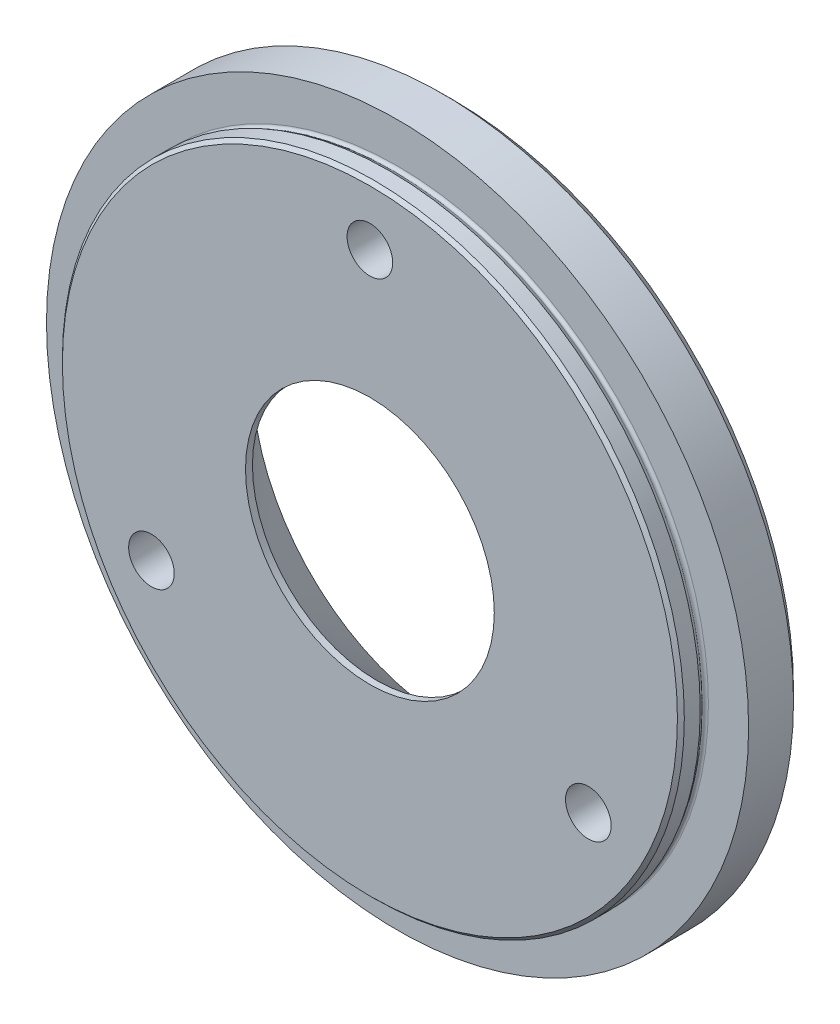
ISO-10303-21;
HEADER;
FILE_DESCRIPTION(('STEP AP214'),'2;1');
FILE_NAME('part.step','',(''),(''),'','','');
FILE_SCHEMA(('AUTOMOTIVE_DESIGN { 1 0 10303 214 1 1 1 1 }'));
ENDSEC;
DATA;
#1=APPLICATION_CONTEXT('core data for automotive mechanical design processes');
#2=APPLICATION_PROTOCOL_DEFINITION('international standard','automotive_design',2000,#1);
#3=PRODUCT_CONTEXT('',#1,'mechanical');
#4=PRODUCT('Part','Part','',(#3));
#5=PRODUCT_RELATED_PRODUCT_CATEGORY('part','',(#4));
#6=PRODUCT_DEFINITION_FORMATION('','',#4);
#7=PRODUCT_DEFINITION_CONTEXT('part definition',#1,'design');
#8=PRODUCT_DEFINITION('design','',#6,#7);
#9=PRODUCT_DEFINITION_SHAPE('','',#8);
#10=(LENGTH_UNIT() NAMED_UNIT(*) SI_UNIT(.MILLI.,.METRE.));
#11=(NAMED_UNIT(*) PLANE_ANGLE_UNIT() SI_UNIT($,.RADIAN.));
#12=(NAMED_UNIT(*) SI_UNIT($,.STERADIAN.) SOLID_ANGLE_UNIT());
#13=UNCERTAINTY_MEASURE_WITH_UNIT(LENGTH_MEASURE(1.E-05),#10,'distance_accuracy_value','');
#14=(GEOMETRIC_REPRESENTATION_CONTEXT(3) GLOBAL_UNCERTAINTY_ASSIGNED_CONTEXT((#13)) GLOBAL_UNIT_ASSIGNED_CONTEXT((#10,
#11,#12)) REPRESENTATION_CONTEXT('',''));
#15=CARTESIAN_POINT('',(0.,0.,0.));
#16=DIRECTION('',(0.,0.,1.));
#17=DIRECTION('',(1.,0.,0.));
#18=AXIS2_PLACEMENT_3D('',#15,#16,#17);
#19=CARTESIAN_POINT('',(0.,0.,4.));
#20=DIRECTION('',(0.,0.,1.));
#21=DIRECTION('',(1.,0.,0.));
#22=AXIS2_PLACEMENT_3D('',#19,#20,#21);
#23=CYLINDRICAL_SURFACE('',#22,45.);
#24=CARTESIAN_POINT('',(0.,0.,3.49999999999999));
#25=DIRECTION('',(0.,0.,1.));
#26=DIRECTION('',(1.,0.,0.));
#27=AXIS2_PLACEMENT_3D('',#24,#25,#26);
#28=CIRCLE('',#27,45.);
#29=CARTESIAN_POINT('',(45.,0.,3.49999999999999));
#30=VERTEX_POINT('',#29);
#31=EDGE_CURVE('E47',#30,#30,#28,.T.);
#32=ORIENTED_EDGE('',*,*,#31,.F.);
#33=EDGE_LOOP('',(#32));
#34=FACE_BOUND('',#33,.T.);
#35=CARTESIAN_POINT('',(0.,0.,1.2));
#36=DIRECTION('',(0.,0.,1.));
#37=DIRECTION('',(1.,0.,0.));
#38=AXIS2_PLACEMENT_3D('',#35,#36,#37);
#39=CIRCLE('',#38,45.);
#40=CARTESIAN_POINT('',(45.,0.,1.2));
#41=VERTEX_POINT('',#40);
#42=EDGE_CURVE('E70',#41,#41,#39,.T.);
#43=ORIENTED_EDGE('',*,*,#42,.T.);
#44=EDGE_LOOP('',(#43));
#45=FACE_BOUND('',#44,.T.);
#46=ADVANCED_FACE('F32',(#34,#45),#23,.T.);
#47=CARTESIAN_POINT('',(0.,44.5,4.));
#48=DIRECTION('',(0.,0.,-1.));
#49=DIRECTION('',(-1.,0.,0.));
#50=AXIS2_PLACEMENT_3D('',#47,#48,#49);
#51=PLANE('',#50);
#52=CARTESIAN_POINT('',(0.,36.5,4.));
#53=DIRECTION('',(0.,0.,-1.));
#54=DIRECTION('',(-1.,0.,0.));
#55=AXIS2_PLACEMENT_3D('',#52,#53,#54);
#56=CIRCLE('',#55,3.3);
#57=CARTESIAN_POINT('',(-3.30000000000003,36.5,4.));
#58=VERTEX_POINT('',#57);
#59=EDGE_CURVE('E97',#58,#58,#56,.T.);
#60=ORIENTED_EDGE('',*,*,#59,.T.);
#61=EDGE_LOOP('',(#60));
#62=FACE_BOUND('',#61,.T.);
#63=CARTESIAN_POINT('',(-31.6099272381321,-18.25,4.));
#64=DIRECTION('',(0.,0.,-1.));
#65=DIRECTION('',(-1.,0.,0.));
#66=AXIS2_PLACEMENT_3D('',#63,#64,#65);
#67=CIRCLE('',#66,3.3);
#68=CARTESIAN_POINT('',(-34.909927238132,-18.25,4.));
#69=VERTEX_POINT('',#68);
#70=EDGE_CURVE('E85',#69,#69,#67,.T.);
#71=ORIENTED_EDGE('',*,*,#70,.T.);
#72=EDGE_LOOP('',(#71));
#73=FACE_BOUND('',#72,.T.);
#74=CARTESIAN_POINT('',(31.609927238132,-18.25,4.));
#75=DIRECTION('',(0.,0.,-1.));
#76=DIRECTION('',(-1.,0.,0.));
#77=AXIS2_PLACEMENT_3D('',#74,#75,#76);
#78=CIRCLE('',#77,3.3);
#79=CARTESIAN_POINT('',(28.309927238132,-18.25,4.));
#80=VERTEX_POINT('',#79);
#81=EDGE_CURVE('E73',#80,#80,#78,.T.);
#82=ORIENTED_EDGE('',*,*,#81,.T.);
#83=EDGE_LOOP('',(#82));
#84=FACE_BOUND('',#83,.T.);
#85=CARTESIAN_POINT('',(0.,0.,4.));
#86=DIRECTION('',(0.,0.,1.));
#87=DIRECTION('',(1.,0.,0.));
#88=AXIS2_PLACEMENT_3D('',#85,#86,#87);
#89=CIRCLE('',#88,18.);
#90=CARTESIAN_POINT('',(18.,0.,4.));
#91=VERTEX_POINT('',#90);
#92=EDGE_CURVE('E10',#91,#91,#89,.T.);
#93=ORIENTED_EDGE('',*,*,#92,.F.);
#94=EDGE_LOOP('',(#93));
#95=FACE_BOUND('',#94,.T.);
#96=CARTESIAN_POINT('',(0.,0.,4.));
#97=DIRECTION('',(0.,0.,1.));
#98=DIRECTION('',(1.,0.,0.));
#99=AXIS2_PLACEMENT_3D('',#96,#97,#98);
#100=CIRCLE('',#99,44.5);
#101=CARTESIAN_POINT('',(44.5,0.,4.));
#102=VERTEX_POINT('',#101);
#103=EDGE_CURVE('E52',#102,#102,#100,.T.);
#104=ORIENTED_EDGE('',*,*,#103,.T.);
#105=EDGE_LOOP('',(#104));
#106=FACE_BOUND('',#105,.T.);
#107=ADVANCED_FACE('F34',(#62,#73,#84,#95,#106),#51,.F.);
#108=CARTESIAN_POINT('',(0.,0.,4.));
#109=DIRECTION('',(0.,0.,1.));
#110=DIRECTION('',(1.,0.,0.));
#111=AXIS2_PLACEMENT_3D('',#108,#109,#110);
#112=CYLINDRICAL_SURFACE('',#111,18.);
#113=CARTESIAN_POINT('',(0.,0.,3.));
#114=DIRECTION('',(0.,0.,1.));
#115=DIRECTION('',(1.,0.,0.));
#116=AXIS2_PLACEMENT_3D('',#113,#114,#115);
#117=CIRCLE('',#116,18.);
#118=CARTESIAN_POINT('',(18.,0.,3.));
#119=VERTEX_POINT('',#118);
#120=EDGE_CURVE('E39',#119,#119,#117,.T.);
#121=ORIENTED_EDGE('',*,*,#120,.F.);
#122=EDGE_LOOP('',(#121));
#123=FACE_BOUND('',#122,.T.);
#124=ORIENTED_EDGE('',*,*,#92,.T.);
#125=EDGE_LOOP('',(#124));
#126=FACE_BOUND('',#125,.T.);
#127=ADVANCED_FACE('F149',(#123,#126),#112,.F.);
#128=CARTESIAN_POINT('',(0.,0.,3.));
#129=DIRECTION('',(0.,0.,-1.));
#130=DIRECTION('',(-1.,0.,0.));
#131=AXIS2_PLACEMENT_3D('',#128,#129,#130);
#132=CONICAL_SURFACE('',#131,18.,0.785398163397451);
#133=CARTESIAN_POINT('',(0.,0.,-8.));
#134=DIRECTION('',(0.,0.,1.));
#135=DIRECTION('',(1.,0.,0.));
#136=AXIS2_PLACEMENT_3D('',#133,#134,#135);
#137=CIRCLE('',#136,29.0000000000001);
#138=CARTESIAN_POINT('',(29.,0.,-8.));
#139=VERTEX_POINT('',#138);
#140=EDGE_CURVE('E43',#139,#139,#137,.T.);
#141=ORIENTED_EDGE('',*,*,#140,.F.);
#142=EDGE_LOOP('',(#141));
#143=FACE_BOUND('',#142,.T.);
#144=ORIENTED_EDGE('',*,*,#120,.T.);
#145=EDGE_LOOP('',(#144));
#146=FACE_BOUND('',#145,.T.);
#147=ADVANCED_FACE('F116',(#143,#146),#132,.F.);
#148=CARTESIAN_POINT('',(0.,29.0000000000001,-8.));
#149=DIRECTION('',(0.,0.,1.));
#150=DIRECTION('',(1.,0.,0.));
#151=AXIS2_PLACEMENT_3D('',#148,#149,#150);
#152=PLANE('',#151);
#153=CARTESIAN_POINT('',(0.,36.5,-8.));
#154=DIRECTION('',(0.,0.,-1.));
#155=DIRECTION('',(-1.,0.,0.));
#156=AXIS2_PLACEMENT_3D('',#153,#154,#155);
#157=CIRCLE('',#156,5.5);
#158=CARTESIAN_POINT('',(-5.50000000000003,36.5,-8.));
#159=VERTEX_POINT('',#158);
#160=EDGE_CURVE('E106',#159,#159,#157,.T.);
#161=ORIENTED_EDGE('',*,*,#160,.F.);
#162=EDGE_LOOP('',(#161));
#163=FACE_BOUND('',#162,.T.);
#164=CARTESIAN_POINT('',(-31.6099272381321,-18.25,-8.));
#165=DIRECTION('',(0.,0.,-1.));
#166=DIRECTION('',(-1.,0.,0.));
#167=AXIS2_PLACEMENT_3D('',#164,#165,#166);
#168=CIRCLE('',#167,5.5);
#169=CARTESIAN_POINT('',(-37.1099272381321,-18.25,-8.));
#170=VERTEX_POINT('',#169);
#171=EDGE_CURVE('E94',#170,#170,#168,.T.);
#172=ORIENTED_EDGE('',*,*,#171,.F.);
#173=EDGE_LOOP('',(#172));
#174=FACE_BOUND('',#173,.T.);
#175=CARTESIAN_POINT('',(31.609927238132,-18.25,-8.));
#176=DIRECTION('',(0.,0.,-1.));
#177=DIRECTION('',(-1.,0.,0.));
#178=AXIS2_PLACEMENT_3D('',#175,#176,#177);
#179=CIRCLE('',#178,5.5);
#180=CARTESIAN_POINT('',(26.109927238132,-18.25,-8.));
#181=VERTEX_POINT('',#180);
#182=EDGE_CURVE('E82',#181,#181,#179,.T.);
#183=ORIENTED_EDGE('',*,*,#182,.F.);
#184=EDGE_LOOP('',(#183));
#185=FACE_BOUND('',#184,.T.);
#186=ORIENTED_EDGE('',*,*,#140,.T.);
#187=EDGE_LOOP('',(#186));
#188=FACE_BOUND('',#187,.T.);
#189=CARTESIAN_POINT('',(0.,0.,-8.));
#190=DIRECTION('',(0.,0.,1.));
#191=DIRECTION('',(1.,0.,0.));
#192=AXIS2_PLACEMENT_3D('',#189,#190,#191);
#193=CIRCLE('',#192,49.3);
#194=CARTESIAN_POINT('',(49.3,0.,-8.));
#195=VERTEX_POINT('',#194);
#196=EDGE_CURVE('E61',#195,#195,#193,.T.);
#197=ORIENTED_EDGE('',*,*,#196,.F.);
#198=EDGE_LOOP('',(#197));
#199=FACE_BOUND('',#198,.T.);
#200=ADVANCED_FACE('F112',(#163,#174,#185,#188,#199),#152,.F.);
#201=CARTESIAN_POINT('',(0.,0.,3.49999999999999));
#202=DIRECTION('',(0.,0.,-1.));
#203=DIRECTION('',(-1.,0.,0.));
#204=AXIS2_PLACEMENT_3D('',#201,#202,#203);
#205=CONICAL_SURFACE('',#204,45.,0.785398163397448);
#206=ORIENTED_EDGE('',*,*,#103,.F.);
#207=EDGE_LOOP('',(#206));
#208=FACE_BOUND('',#207,.T.);
#209=ORIENTED_EDGE('',*,*,#31,.T.);
#210=EDGE_LOOP('',(#209));
#211=FACE_BOUND('',#210,.T.);
#212=ADVANCED_FACE('F115',(#208,#211),#205,.T.);
#213=CARTESIAN_POINT('',(0.,45.,0.));
#214=DIRECTION('',(0.,0.,-1.));
#215=DIRECTION('',(-1.,0.,0.));
#216=AXIS2_PLACEMENT_3D('',#213,#214,#215);
#217=PLANE('',#216);
#218=CARTESIAN_POINT('',(0.,0.,0.));
#219=DIRECTION('',(0.,0.,1.));
#220=DIRECTION('',(1.,0.,0.));
#221=AXIS2_PLACEMENT_3D('',#218,#219,#220);
#222=CIRCLE('',#221,50.8);
#223=CARTESIAN_POINT('',(50.8,0.,0.));
#224=VERTEX_POINT('',#223);
#225=EDGE_CURVE('E55',#224,#224,#222,.T.);
#226=ORIENTED_EDGE('',*,*,#225,.T.);
#227=EDGE_LOOP('',(#226));
#228=FACE_BOUND('',#227,.T.);
#229=CARTESIAN_POINT('',(0.,0.,0.));
#230=DIRECTION('',(0.,0.,1.));
#231=DIRECTION('',(1.,0.,0.));
#232=AXIS2_PLACEMENT_3D('',#229,#230,#231);
#233=CIRCLE('',#232,44.9859648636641);
#234=CARTESIAN_POINT('',(44.9859648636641,0.,0.));
#235=VERTEX_POINT('',#234);
#236=EDGE_CURVE('E64',#235,#235,#233,.T.);
#237=ORIENTED_EDGE('',*,*,#236,.F.);
#238=EDGE_LOOP('',(#237));
#239=FACE_BOUND('',#238,.T.);
#240=ADVANCED_FACE('F139',(#228,#239),#217,.F.);
#241=CARTESIAN_POINT('',(0.,0.,4.));
#242=DIRECTION('',(0.,0.,1.));
#243=DIRECTION('',(1.,0.,0.));
#244=AXIS2_PLACEMENT_3D('',#241,#242,#243);
#245=CYLINDRICAL_SURFACE('',#244,50.8);
#246=ORIENTED_EDGE('',*,*,#225,.F.);
#247=EDGE_LOOP('',(#246));
#248=FACE_BOUND('',#247,.T.);
#249=CARTESIAN_POINT('',(0.,0.,-6.5));
#250=DIRECTION('',(0.,0.,1.));
#251=DIRECTION('',(1.,0.,0.));
#252=AXIS2_PLACEMENT_3D('',#249,#250,#251);
#253=CIRCLE('',#252,50.8);
#254=CARTESIAN_POINT('',(50.8,0.,-6.5));
#255=VERTEX_POINT('',#254);
#256=EDGE_CURVE('E58',#255,#255,#253,.T.);
#257=ORIENTED_EDGE('',*,*,#256,.T.);
#258=EDGE_LOOP('',(#257));
#259=FACE_BOUND('',#258,.T.);
#260=ADVANCED_FACE('F129',(#248,#259),#245,.T.);
#261=CARTESIAN_POINT('',(0.,0.,-8.));
#262=DIRECTION('',(0.,0.,1.));
#263=DIRECTION('',(1.,0.,0.));
#264=AXIS2_PLACEMENT_3D('',#261,#262,#263);
#265=CONICAL_SURFACE('',#264,49.3,0.785398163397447);
#266=ORIENTED_EDGE('',*,*,#256,.F.);
#267=EDGE_LOOP('',(#266));
#268=FACE_BOUND('',#267,.T.);
#269=ORIENTED_EDGE('',*,*,#196,.T.);
#270=EDGE_LOOP('',(#269));
#271=FACE_BOUND('',#270,.T.);
#272=ADVANCED_FACE('F126',(#268,#271),#265,.T.);
#273=CARTESIAN_POINT('',(0.,0.,0.400000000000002));
#274=DIRECTION('',(0.,0.,1.));
#275=DIRECTION('',(1.,0.,0.));
#276=AXIS2_PLACEMENT_3D('',#273,#274,#275);
#277=TOROIDAL_SURFACE('',#276,44.9859648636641,0.400000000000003);
#278=ORIENTED_EDGE('',*,*,#236,.T.);
#279=EDGE_LOOP('',(#278));
#280=FACE_BOUND('',#279,.T.);
#281=CARTESIAN_POINT('',(0.,0.,0.606015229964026));
#282=DIRECTION('',(0.,0.,1.));
#283=DIRECTION('',(1.,0.,0.));
#284=AXIS2_PLACEMENT_3D('',#281,#282,#283);
#285=CIRCLE('',#284,44.6430979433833);
#286=CARTESIAN_POINT('',(44.6430979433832,0.,0.606015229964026));
#287=VERTEX_POINT('',#286);
#288=EDGE_CURVE('E67',#287,#287,#285,.T.);
#289=ORIENTED_EDGE('',*,*,#288,.F.);
#290=EDGE_LOOP('',(#289));
#291=FACE_BOUND('',#290,.T.);
#292=ADVANCED_FACE('F128',(#280,#291),#277,.F.);
#293=CARTESIAN_POINT('',(0.,0.,1.2));
#294=DIRECTION('',(0.,0.,1.));
#295=DIRECTION('',(1.,0.,0.));
#296=AXIS2_PLACEMENT_3D('',#293,#294,#295);
#297=CONICAL_SURFACE('',#296,45.,0.541052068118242);
#298=ORIENTED_EDGE('',*,*,#288,.T.);
#299=EDGE_LOOP('',(#298));
#300=FACE_BOUND('',#299,.T.);
#301=ORIENTED_EDGE('',*,*,#42,.F.);
#302=EDGE_LOOP('',(#301));
#303=FACE_BOUND('',#302,.T.);
#304=ADVANCED_FACE('F136',(#300,#303),#297,.T.);
#305=CARTESIAN_POINT('',(31.609927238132,-18.25,-8.));
#306=DIRECTION('',(0.,0.,-1.));
#307=DIRECTION('',(-1.,0.,0.));
#308=AXIS2_PLACEMENT_3D('',#305,#306,#307);
#309=CYLINDRICAL_SURFACE('',#308,3.3);
#310=ORIENTED_EDGE('',*,*,#81,.F.);
#311=EDGE_LOOP('',(#310));
#312=FACE_BOUND('',#311,.T.);
#313=CARTESIAN_POINT('',(31.609927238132,-18.25,-1.));
#314=DIRECTION('',(0.,0.,-1.));
#315=DIRECTION('',(-1.,0.,0.));
#316=AXIS2_PLACEMENT_3D('',#313,#314,#315);
#317=CIRCLE('',#316,3.3);
#318=CARTESIAN_POINT('',(28.309927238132,-18.25,-1.));
#319=VERTEX_POINT('',#318);
#320=EDGE_CURVE('E76',#319,#319,#317,.T.);
#321=ORIENTED_EDGE('',*,*,#320,.T.);
#322=EDGE_LOOP('',(#321));
#323=FACE_BOUND('',#322,.T.);
#324=ADVANCED_FACE('F217',(#312,#323),#309,.F.);
#325=CARTESIAN_POINT('',(34.909927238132,-18.25,-1.));
#326=DIRECTION('',(0.,0.,1.));
#327=DIRECTION('',(1.,0.,0.));
#328=AXIS2_PLACEMENT_3D('',#325,#326,#327);
#329=PLANE('',#328);
#330=ORIENTED_EDGE('',*,*,#320,.F.);
#331=EDGE_LOOP('',(#330));
#332=FACE_BOUND('',#331,.T.);
#333=CARTESIAN_POINT('',(31.609927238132,-18.25,-1.));
#334=DIRECTION('',(0.,0.,-1.));
#335=DIRECTION('',(-1.,0.,0.));
#336=AXIS2_PLACEMENT_3D('',#333,#334,#335);
#337=CIRCLE('',#336,5.5);
#338=CARTESIAN_POINT('',(26.109927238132,-18.25,-1.));
#339=VERTEX_POINT('',#338);
#340=EDGE_CURVE('E79',#339,#339,#337,.T.);
#341=ORIENTED_EDGE('',*,*,#340,.T.);
#342=EDGE_LOOP('',(#341));
#343=FACE_BOUND('',#342,.T.);
#344=ADVANCED_FACE('F225',(#332,#343),#329,.F.);
#345=CARTESIAN_POINT('',(31.609927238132,-18.25,-8.));
#346=DIRECTION('',(0.,0.,-1.));
#347=DIRECTION('',(-1.,0.,0.));
#348=AXIS2_PLACEMENT_3D('',#345,#346,#347);
#349=CYLINDRICAL_SURFACE('',#348,5.5);
#350=ORIENTED_EDGE('',*,*,#340,.F.);
#351=EDGE_LOOP('',(#350));
#352=FACE_BOUND('',#351,.T.);
#353=ORIENTED_EDGE('',*,*,#182,.T.);
#354=EDGE_LOOP('',(#353));
#355=FACE_BOUND('',#354,.T.);
#356=ADVANCED_FACE('F234',(#352,#355),#349,.F.);
#357=CARTESIAN_POINT('',(-31.6099272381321,-18.25,-8.));
#358=DIRECTION('',(0.,0.,-1.));
#359=DIRECTION('',(-1.,0.,0.));
#360=AXIS2_PLACEMENT_3D('',#357,#358,#359);
#361=CYLINDRICAL_SURFACE('',#360,3.3);
#362=ORIENTED_EDGE('',*,*,#70,.F.);
#363=EDGE_LOOP('',(#362));
#364=FACE_BOUND('',#363,.T.);
#365=CARTESIAN_POINT('',(-31.6099272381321,-18.25,-1.));
#366=DIRECTION('',(0.,0.,-1.));
#367=DIRECTION('',(-1.,0.,0.));
#368=AXIS2_PLACEMENT_3D('',#365,#366,#367);
#369=CIRCLE('',#368,3.3);
#370=CARTESIAN_POINT('',(-34.909927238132,-18.25,-1.));
#371=VERTEX_POINT('',#370);
#372=EDGE_CURVE('E88',#371,#371,#369,.T.);
#373=ORIENTED_EDGE('',*,*,#372,.T.);
#374=EDGE_LOOP('',(#373));
#375=FACE_BOUND('',#374,.T.);
#376=ADVANCED_FACE('F243',(#364,#375),#361,.F.);
#377=CARTESIAN_POINT('',(-28.3099272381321,-18.25,-1.));
#378=DIRECTION('',(0.,0.,1.));
#379=DIRECTION('',(1.,0.,0.));
#380=AXIS2_PLACEMENT_3D('',#377,#378,#379);
#381=PLANE('',#380);
#382=ORIENTED_EDGE('',*,*,#372,.F.);
#383=EDGE_LOOP('',(#382));
#384=FACE_BOUND('',#383,.T.);
#385=CARTESIAN_POINT('',(-31.6099272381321,-18.25,-1.));
#386=DIRECTION('',(0.,0.,-1.));
#387=DIRECTION('',(-1.,0.,0.));
#388=AXIS2_PLACEMENT_3D('',#385,#386,#387);
#389=CIRCLE('',#388,5.5);
#390=CARTESIAN_POINT('',(-37.1099272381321,-18.25,-1.));
#391=VERTEX_POINT('',#390);
#392=EDGE_CURVE('E91',#391,#391,#389,.T.);
#393=ORIENTED_EDGE('',*,*,#392,.T.);
#394=EDGE_LOOP('',(#393));
#395=FACE_BOUND('',#394,.T.);
#396=ADVANCED_FACE('F252',(#384,#395),#381,.F.);
#397=CARTESIAN_POINT('',(-31.6099272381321,-18.25,-8.));
#398=DIRECTION('',(0.,0.,-1.));
#399=DIRECTION('',(-1.,0.,0.));
#400=AXIS2_PLACEMENT_3D('',#397,#398,#399);
#401=CYLINDRICAL_SURFACE('',#400,5.5);
#402=ORIENTED_EDGE('',*,*,#392,.F.);
#403=EDGE_LOOP('',(#402));
#404=FACE_BOUND('',#403,.T.);
#405=ORIENTED_EDGE('',*,*,#171,.T.);
#406=EDGE_LOOP('',(#405));
#407=FACE_BOUND('',#406,.T.);
#408=ADVANCED_FACE('F261',(#404,#407),#401,.F.);
#409=CARTESIAN_POINT('',(0.,36.5,-8.));
#410=DIRECTION('',(0.,0.,-1.));
#411=DIRECTION('',(-1.,0.,0.));
#412=AXIS2_PLACEMENT_3D('',#409,#410,#411);
#413=CYLINDRICAL_SURFACE('',#412,3.3);
#414=ORIENTED_EDGE('',*,*,#59,.F.);
#415=EDGE_LOOP('',(#414));
#416=FACE_BOUND('',#415,.T.);
#417=CARTESIAN_POINT('',(0.,36.5,-1.));
#418=DIRECTION('',(0.,0.,-1.));
#419=DIRECTION('',(-1.,0.,0.));
#420=AXIS2_PLACEMENT_3D('',#417,#418,#419);
#421=CIRCLE('',#420,3.3);
#422=CARTESIAN_POINT('',(-3.30000000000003,36.5,-1.));
#423=VERTEX_POINT('',#422);
#424=EDGE_CURVE('E100',#423,#423,#421,.T.);
#425=ORIENTED_EDGE('',*,*,#424,.T.);
#426=EDGE_LOOP('',(#425));
#427=FACE_BOUND('',#426,.T.);
#428=ADVANCED_FACE('F270',(#416,#427),#413,.F.);
#429=CARTESIAN_POINT('',(3.29999999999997,36.5,-1.));
#430=DIRECTION('',(0.,0.,1.));
#431=DIRECTION('',(1.,0.,0.));
#432=AXIS2_PLACEMENT_3D('',#429,#430,#431);
#433=PLANE('',#432);
#434=ORIENTED_EDGE('',*,*,#424,.F.);
#435=EDGE_LOOP('',(#434));
#436=FACE_BOUND('',#435,.T.);
#437=CARTESIAN_POINT('',(0.,36.5,-1.));
#438=DIRECTION('',(0.,0.,-1.));
#439=DIRECTION('',(-1.,0.,0.));
#440=AXIS2_PLACEMENT_3D('',#437,#438,#439);
#441=CIRCLE('',#440,5.5);
#442=CARTESIAN_POINT('',(-5.50000000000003,36.5,-1.));
#443=VERTEX_POINT('',#442);
#444=EDGE_CURVE('E103',#443,#443,#441,.T.);
#445=ORIENTED_EDGE('',*,*,#444,.T.);
#446=EDGE_LOOP('',(#445));
#447=FACE_BOUND('',#446,.T.);
#448=ADVANCED_FACE('F279',(#436,#447),#433,.F.);
#449=CARTESIAN_POINT('',(0.,36.5,-8.));
#450=DIRECTION('',(0.,0.,-1.));
#451=DIRECTION('',(-1.,0.,0.));
#452=AXIS2_PLACEMENT_3D('',#449,#450,#451);
#453=CYLINDRICAL_SURFACE('',#452,5.5);
#454=ORIENTED_EDGE('',*,*,#444,.F.);
#455=EDGE_LOOP('',(#454));
#456=FACE_BOUND('',#455,.T.);
#457=ORIENTED_EDGE('',*,*,#160,.T.);
#458=EDGE_LOOP('',(#457));
#459=FACE_BOUND('',#458,.T.);
#460=ADVANCED_FACE('F110',(#456,#459),#453,.F.);
#461=CLOSED_SHELL('',(#46,#107,#127,#147,#200,#212,#240,#260,#272,#292,#304,#324,#344,#356,#376,
#396,#408,#428,#448,#460));
#462=MANIFOLD_SOLID_BREP('B2',#461);
#463=ADVANCED_BREP_SHAPE_REPRESENTATION('',(#18,#462),#14);
#464=SHAPE_DEFINITION_REPRESENTATION(#9,#463);
ENDSEC;
END-ISO-10303-21;
